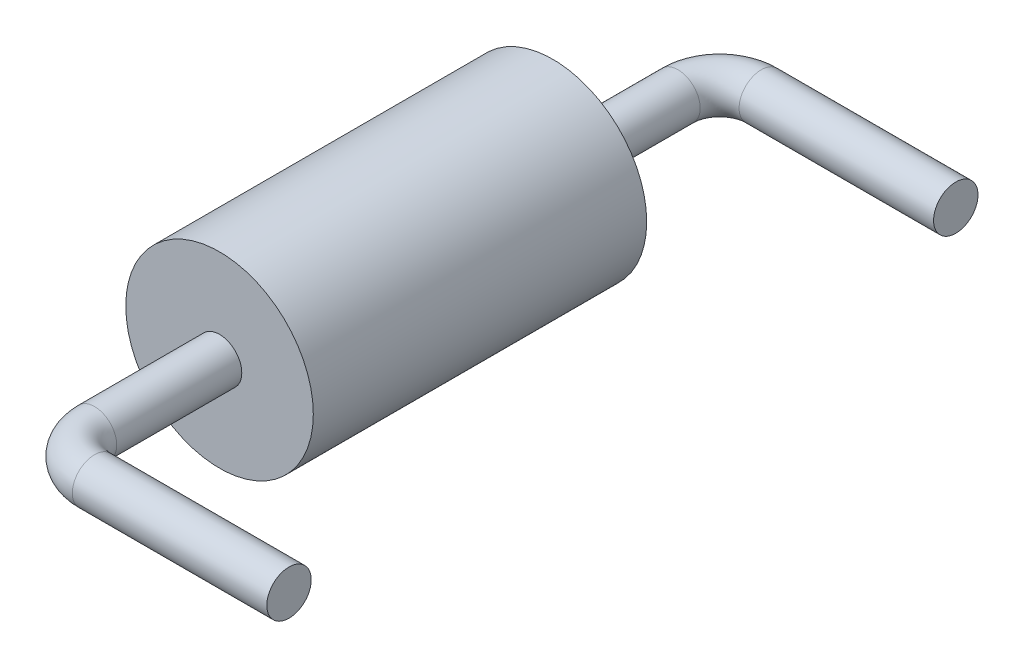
ISO-10303-21;
HEADER;
FILE_DESCRIPTION(('STEP AP214'),'2;1');
FILE_NAME('part.step','',(''),(''),'','','');
FILE_SCHEMA(('AUTOMOTIVE_DESIGN { 1 0 10303 214 1 1 1 1 }'));
ENDSEC;
DATA;
#1=APPLICATION_CONTEXT('core data for automotive mechanical design processes');
#2=APPLICATION_PROTOCOL_DEFINITION('international standard','automotive_design',2000,#1);
#3=PRODUCT_CONTEXT('',#1,'mechanical');
#4=PRODUCT('Part','Part','',(#3));
#5=PRODUCT_RELATED_PRODUCT_CATEGORY('part','',(#4));
#6=PRODUCT_DEFINITION_FORMATION('','',#4);
#7=PRODUCT_DEFINITION_CONTEXT('part definition',#1,'design');
#8=PRODUCT_DEFINITION('design','',#6,#7);
#9=PRODUCT_DEFINITION_SHAPE('','',#8);
#10=(LENGTH_UNIT() NAMED_UNIT(*) SI_UNIT(.MILLI.,.METRE.));
#11=(NAMED_UNIT(*) PLANE_ANGLE_UNIT() SI_UNIT($,.RADIAN.));
#12=(NAMED_UNIT(*) SI_UNIT($,.STERADIAN.) SOLID_ANGLE_UNIT());
#13=UNCERTAINTY_MEASURE_WITH_UNIT(LENGTH_MEASURE(1.E-05),#10,'distance_accuracy_value','');
#14=(GEOMETRIC_REPRESENTATION_CONTEXT(3) GLOBAL_UNCERTAINTY_ASSIGNED_CONTEXT((#13)) GLOBAL_UNIT_ASSIGNED_CONTEXT((#10,
#11,#12)) REPRESENTATION_CONTEXT('',''));
#15=CARTESIAN_POINT('',(0.,0.,0.));
#16=DIRECTION('',(0.,0.,1.));
#17=DIRECTION('',(1.,0.,0.));
#18=AXIS2_PLACEMENT_3D('',#15,#16,#17);
#19=CARTESIAN_POINT('',(0.,0.,4.8));
#20=DIRECTION('',(0.,0.,-1.));
#21=DIRECTION('',(-1.,0.,0.));
#22=AXIS2_PLACEMENT_3D('',#19,#20,#21);
#23=CYLINDRICAL_SURFACE('',#22,1.35);
#24=CARTESIAN_POINT('',(0.,0.,4.8));
#25=DIRECTION('',(0.,0.,1.));
#26=DIRECTION('',(1.,0.,0.));
#27=AXIS2_PLACEMENT_3D('',#24,#25,#26);
#28=CIRCLE('',#27,1.35);
#29=CARTESIAN_POINT('',(1.35,0.,4.8));
#30=VERTEX_POINT('',#29);
#31=EDGE_CURVE('E66',#30,#30,#28,.T.);
#32=ORIENTED_EDGE('',*,*,#31,.F.);
#33=EDGE_LOOP('',(#32));
#34=FACE_BOUND('',#33,.T.);
#35=CARTESIAN_POINT('',(0.,0.,0.));
#36=DIRECTION('',(0.,0.,1.));
#37=DIRECTION('',(1.,0.,0.));
#38=AXIS2_PLACEMENT_3D('',#35,#36,#37);
#39=CIRCLE('',#38,1.35);
#40=CARTESIAN_POINT('',(1.35,0.,0.));
#41=VERTEX_POINT('',#40);
#42=EDGE_CURVE('E71',#41,#41,#39,.T.);
#43=ORIENTED_EDGE('',*,*,#42,.T.);
#44=EDGE_LOOP('',(#43));
#45=FACE_BOUND('',#44,.T.);
#46=ADVANCED_FACE('F35',(#34,#45),#23,.T.);
#47=CARTESIAN_POINT('',(0.,0.,4.8));
#48=DIRECTION('',(0.,0.,1.));
#49=DIRECTION('',(1.,0.,0.));
#50=AXIS2_PLACEMENT_3D('',#47,#48,#49);
#51=PLANE('',#50);
#52=CARTESIAN_POINT('',(0.,0.,4.8));
#53=DIRECTION('',(0.,0.,1.));
#54=DIRECTION('',(1.,0.,0.));
#55=AXIS2_PLACEMENT_3D('',#52,#53,#54);
#56=CIRCLE('',#55,0.32);
#57=CARTESIAN_POINT('',(0.32,0.,4.8));
#58=VERTEX_POINT('',#57);
#59=EDGE_CURVE('E11',#58,#58,#56,.T.);
#60=ORIENTED_EDGE('',*,*,#59,.F.);
#61=EDGE_LOOP('',(#60));
#62=FACE_BOUND('',#61,.T.);
#63=ORIENTED_EDGE('',*,*,#31,.T.);
#64=EDGE_LOOP('',(#63));
#65=FACE_BOUND('',#64,.T.);
#66=ADVANCED_FACE('F80',(#62,#65),#51,.T.);
#67=CARTESIAN_POINT('',(0.,0.,0.));
#68=DIRECTION('',(0.,0.,1.));
#69=DIRECTION('',(1.,0.,0.));
#70=AXIS2_PLACEMENT_3D('',#67,#68,#69);
#71=PLANE('',#70);
#72=CARTESIAN_POINT('',(0.,0.,0.));
#73=DIRECTION('',(0.,0.,-1.));
#74=DIRECTION('',(-1.,0.,0.));
#75=AXIS2_PLACEMENT_3D('',#72,#73,#74);
#76=CIRCLE('',#75,0.32);
#77=CARTESIAN_POINT('',(-0.32,0.,0.));
#78=VERTEX_POINT('',#77);
#79=EDGE_CURVE('E42',#78,#78,#76,.T.);
#80=ORIENTED_EDGE('',*,*,#79,.F.);
#81=EDGE_LOOP('',(#80));
#82=FACE_BOUND('',#81,.T.);
#83=ORIENTED_EDGE('',*,*,#42,.F.);
#84=EDGE_LOOP('',(#83));
#85=FACE_BOUND('',#84,.T.);
#86=ADVANCED_FACE('F77',(#82,#85),#71,.F.);
#87=CARTESIAN_POINT('',(3.4,0.,-2.4));
#88=DIRECTION('',(1.,0.,0.));
#89=DIRECTION('',(0.,0.,-1.));
#90=AXIS2_PLACEMENT_3D('',#87,#88,#89);
#91=PLANE('',#90);
#92=CARTESIAN_POINT('',(3.4,0.,-2.4));
#93=DIRECTION('',(1.,0.,0.));
#94=DIRECTION('',(0.,0.,-1.));
#95=AXIS2_PLACEMENT_3D('',#92,#93,#94);
#96=CIRCLE('',#95,0.32);
#97=CARTESIAN_POINT('',(3.4,0.,-2.72));
#98=VERTEX_POINT('',#97);
#99=EDGE_CURVE('E47',#98,#98,#96,.T.);
#100=ORIENTED_EDGE('',*,*,#99,.T.);
#101=EDGE_LOOP('',(#100));
#102=FACE_BOUND('',#101,.T.);
#103=ADVANCED_FACE('F79',(#102),#91,.T.);
#104=CARTESIAN_POINT('',(0.,0.,0.));
#105=DIRECTION('',(0.,0.,-1.));
#106=DIRECTION('',(-1.,0.,0.));
#107=AXIS2_PLACEMENT_3D('',#104,#105,#106);
#108=CYLINDRICAL_SURFACE('',#107,0.32);
#109=CARTESIAN_POINT('',(0.,0.,-1.8));
#110=DIRECTION('',(0.,0.,-1.));
#111=DIRECTION('',(-1.,0.,0.));
#112=AXIS2_PLACEMENT_3D('',#109,#110,#111);
#113=CIRCLE('',#112,0.32);
#114=CARTESIAN_POINT('',(-0.32,0.,-1.79999999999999));
#115=VERTEX_POINT('',#114);
#116=EDGE_CURVE('E54',#115,#115,#113,.T.);
#117=ORIENTED_EDGE('',*,*,#116,.F.);
#118=EDGE_LOOP('',(#117));
#119=FACE_BOUND('',#118,.T.);
#120=ORIENTED_EDGE('',*,*,#79,.T.);
#121=EDGE_LOOP('',(#120));
#122=FACE_BOUND('',#121,.T.);
#123=ADVANCED_FACE('F87',(#119,#122),#108,.T.);
#124=CARTESIAN_POINT('',(0.6,0.,-1.8));
#125=DIRECTION('',(0.,-1.,0.));
#126=DIRECTION('',(0.,0.,-1.));
#127=AXIS2_PLACEMENT_3D('',#124,#125,#126);
#128=TOROIDAL_SURFACE('',#127,0.6,0.32);
#129=CARTESIAN_POINT('',(0.6,0.,-2.4));
#130=DIRECTION('',(1.,0.,0.));
#131=DIRECTION('',(0.,0.,-1.));
#132=AXIS2_PLACEMENT_3D('',#129,#130,#131);
#133=CIRCLE('',#132,0.32);
#134=CARTESIAN_POINT('',(0.6,0.,-2.72));
#135=VERTEX_POINT('',#134);
#136=EDGE_CURVE('E58',#135,#135,#133,.T.);
#137=CARTESIAN_POINT('',(0.6,0.,-1.8));
#138=DIRECTION('',(0.,-1.,0.));
#139=DIRECTION('',(0.,0.,-1.));
#140=AXIS2_PLACEMENT_3D('',#137,#138,#139);
#141=CIRCLE('',#140,0.92);
#142=EDGE_CURVE('',#115,#135,#141,.T.);
#143=ORIENTED_EDGE('',*,*,#116,.T.);
#144=ORIENTED_EDGE('',*,*,#136,.F.);
#145=ORIENTED_EDGE('',*,*,#142,.T.);
#146=ORIENTED_EDGE('',*,*,#142,.F.);
#147=EDGE_LOOP('',(#143,#145,#144,#146));
#148=FACE_BOUND('',#147,.T.);
#149=ADVANCED_FACE('F94',(#148),#128,.T.);
#150=CARTESIAN_POINT('',(0.6,0.,-2.4));
#151=DIRECTION('',(1.,0.,0.));
#152=DIRECTION('',(0.,0.,-1.));
#153=AXIS2_PLACEMENT_3D('',#150,#151,#152);
#154=CYLINDRICAL_SURFACE('',#153,0.32);
#155=ORIENTED_EDGE('',*,*,#99,.F.);
#156=EDGE_LOOP('',(#155));
#157=FACE_BOUND('',#156,.T.);
#158=ORIENTED_EDGE('',*,*,#136,.T.);
#159=EDGE_LOOP('',(#158));
#160=FACE_BOUND('',#159,.T.);
#161=ADVANCED_FACE('F82',(#157,#160),#154,.T.);
#162=CARTESIAN_POINT('',(3.4,0.,7.2));
#163=DIRECTION('',(1.,0.,0.));
#164=DIRECTION('',(0.,0.,1.));
#165=AXIS2_PLACEMENT_3D('',#162,#163,#164);
#166=PLANE('',#165);
#167=CARTESIAN_POINT('',(3.4,0.,7.2));
#168=DIRECTION('',(-1.,0.,0.));
#169=DIRECTION('',(0.,0.,1.));
#170=AXIS2_PLACEMENT_3D('',#167,#168,#169);
#171=CIRCLE('',#170,0.32);
#172=CARTESIAN_POINT('',(3.4,0.,7.52));
#173=VERTEX_POINT('',#172);
#174=EDGE_CURVE('E51',#173,#173,#171,.F.);
#175=ORIENTED_EDGE('',*,*,#174,.T.);
#176=EDGE_LOOP('',(#175));
#177=FACE_BOUND('',#176,.T.);
#178=ADVANCED_FACE('F52',(#177),#166,.T.);
#179=CARTESIAN_POINT('',(0.,0.,4.8));
#180=DIRECTION('',(0.,0.,1.));
#181=DIRECTION('',(1.,0.,0.));
#182=AXIS2_PLACEMENT_3D('',#179,#180,#181);
#183=CYLINDRICAL_SURFACE('',#182,0.32);
#184=CARTESIAN_POINT('',(0.,0.,6.59999999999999));
#185=DIRECTION('',(0.,0.,-1.));
#186=DIRECTION('',(-1.,0.,0.));
#187=AXIS2_PLACEMENT_3D('',#184,#185,#186);
#188=CIRCLE('',#187,0.32);
#189=CARTESIAN_POINT('',(-0.319999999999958,0.,6.59999999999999));
#190=VERTEX_POINT('',#189);
#191=EDGE_CURVE('E61',#190,#190,#188,.F.);
#192=ORIENTED_EDGE('',*,*,#191,.F.);
#193=EDGE_LOOP('',(#192));
#194=FACE_BOUND('',#193,.T.);
#195=ORIENTED_EDGE('',*,*,#59,.T.);
#196=EDGE_LOOP('',(#195));
#197=FACE_BOUND('',#196,.T.);
#198=ADVANCED_FACE('F121',(#194,#197),#183,.T.);
#199=CARTESIAN_POINT('',(0.6,0.,6.6));
#200=DIRECTION('',(0.,1.,0.));
#201=DIRECTION('',(0.,0.,1.));
#202=AXIS2_PLACEMENT_3D('',#199,#200,#201);
#203=TOROIDAL_SURFACE('',#202,0.599999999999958,0.32);
#204=CARTESIAN_POINT('',(0.6,0.,7.2));
#205=DIRECTION('',(-1.,0.,0.));
#206=DIRECTION('',(0.,0.,1.));
#207=AXIS2_PLACEMENT_3D('',#204,#205,#206);
#208=CIRCLE('',#207,0.32);
#209=CARTESIAN_POINT('',(0.6,0.,7.51999999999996));
#210=VERTEX_POINT('',#209);
#211=EDGE_CURVE('E55',#210,#210,#208,.F.);
#212=CARTESIAN_POINT('',(0.6,0.,6.6));
#213=DIRECTION('',(0.,1.,0.));
#214=DIRECTION('',(0.,0.,1.));
#215=AXIS2_PLACEMENT_3D('',#212,#213,#214);
#216=CIRCLE('',#215,0.919999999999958);
#217=EDGE_CURVE('',#190,#210,#216,.T.);
#218=ORIENTED_EDGE('',*,*,#191,.T.);
#219=ORIENTED_EDGE('',*,*,#211,.F.);
#220=ORIENTED_EDGE('',*,*,#217,.T.);
#221=ORIENTED_EDGE('',*,*,#217,.F.);
#222=EDGE_LOOP('',(#218,#220,#219,#221));
#223=FACE_BOUND('',#222,.T.);
#224=ADVANCED_FACE('F130',(#223),#203,.T.);
#225=CARTESIAN_POINT('',(0.6,0.,7.2));
#226=DIRECTION('',(1.,0.,0.));
#227=DIRECTION('',(0.,0.,-1.));
#228=AXIS2_PLACEMENT_3D('',#225,#226,#227);
#229=CYLINDRICAL_SURFACE('',#228,0.32);
#230=ORIENTED_EDGE('',*,*,#174,.F.);
#231=EDGE_LOOP('',(#230));
#232=FACE_BOUND('',#231,.T.);
#233=ORIENTED_EDGE('',*,*,#211,.T.);
#234=EDGE_LOOP('',(#233));
#235=FACE_BOUND('',#234,.T.);
#236=ADVANCED_FACE('F89',(#232,#235),#229,.T.);
#237=CLOSED_SHELL('',(#46,#66,#86,#103,#123,#149,#161,#178,#198,#224,#236));
#238=MANIFOLD_SOLID_BREP('B2',#237);
#239=ADVANCED_BREP_SHAPE_REPRESENTATION('',(#18,#238),#14);
#240=SHAPE_DEFINITION_REPRESENTATION(#9,#239);
ENDSEC;
END-ISO-10303-21;
